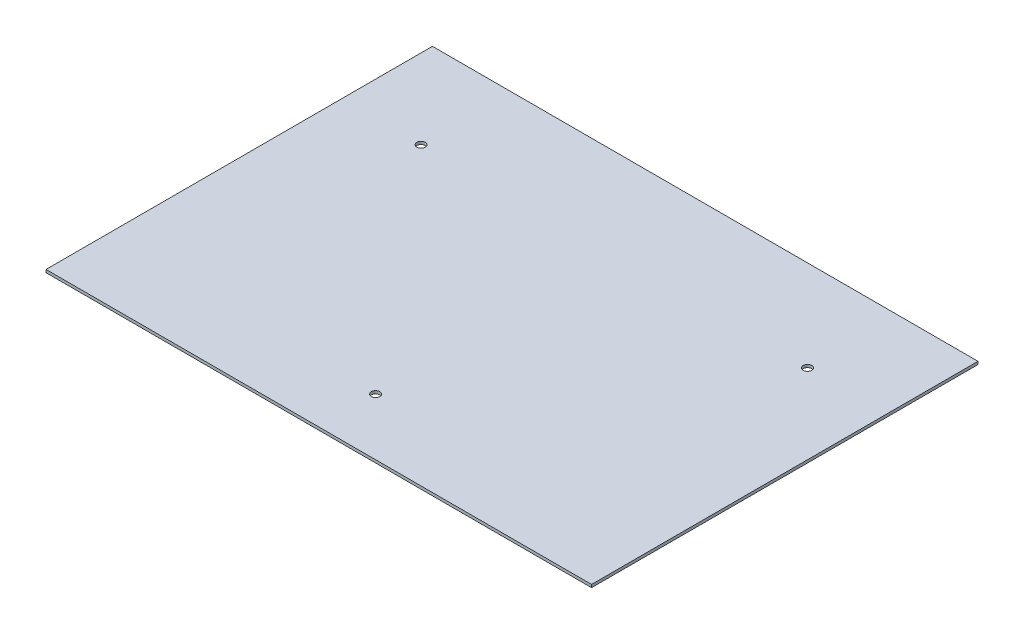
ISO-10303-21;
HEADER;
FILE_DESCRIPTION(('STEP AP214'),'2;1');
FILE_NAME('part.step','',(''),(''),'','','');
FILE_SCHEMA(('AUTOMOTIVE_DESIGN { 1 0 10303 214 1 1 1 1 }'));
ENDSEC;
DATA;
#1=APPLICATION_CONTEXT('core data for automotive mechanical design processes');
#2=APPLICATION_PROTOCOL_DEFINITION('international standard','automotive_design',2000,#1);
#3=PRODUCT_CONTEXT('',#1,'mechanical');
#4=PRODUCT('Part','Part','',(#3));
#5=PRODUCT_RELATED_PRODUCT_CATEGORY('part','',(#4));
#6=PRODUCT_DEFINITION_FORMATION('','',#4);
#7=PRODUCT_DEFINITION_CONTEXT('part definition',#1,'design');
#8=PRODUCT_DEFINITION('design','',#6,#7);
#9=PRODUCT_DEFINITION_SHAPE('','',#8);
#10=(LENGTH_UNIT() NAMED_UNIT(*) SI_UNIT(.MILLI.,.METRE.));
#11=(NAMED_UNIT(*) PLANE_ANGLE_UNIT() SI_UNIT($,.RADIAN.));
#12=(NAMED_UNIT(*) SI_UNIT($,.STERADIAN.) SOLID_ANGLE_UNIT());
#13=UNCERTAINTY_MEASURE_WITH_UNIT(LENGTH_MEASURE(1.E-05),#10,'distance_accuracy_value','');
#14=(GEOMETRIC_REPRESENTATION_CONTEXT(3) GLOBAL_UNCERTAINTY_ASSIGNED_CONTEXT((#13)) GLOBAL_UNIT_ASSIGNED_CONTEXT((#10,
#11,#12)) REPRESENTATION_CONTEXT('',''));
#15=CARTESIAN_POINT('',(0.,0.,0.));
#16=DIRECTION('',(0.,0.,1.));
#17=DIRECTION('',(1.,0.,0.));
#18=AXIS2_PLACEMENT_3D('',#15,#16,#17);
#19=CARTESIAN_POINT('',(304.8,3.175,215.9));
#20=DIRECTION('',(-1.,0.,0.));
#21=DIRECTION('',(0.,0.,1.));
#22=AXIS2_PLACEMENT_3D('',#19,#20,#21);
#23=PLANE('',#22);
#24=DIRECTION('',(0.,0.,-1.));
#25=VECTOR('',#24,1.);
#26=CARTESIAN_POINT('',(304.8,0.,215.9));
#27=LINE('',#26,#25);
#28=CARTESIAN_POINT('',(304.8,0.,215.9));
#29=VERTEX_POINT('',#28);
#30=CARTESIAN_POINT('',(304.8,0.,-215.9));
#31=VERTEX_POINT('',#30);
#32=EDGE_CURVE('E95',#29,#31,#27,.T.);
#33=ORIENTED_EDGE('',*,*,#32,.T.);
#34=DIRECTION('',(0.,-1.,0.));
#35=VECTOR('',#34,1.);
#36=CARTESIAN_POINT('',(304.8,3.175,-215.9));
#37=LINE('',#36,#35);
#38=CARTESIAN_POINT('',(304.8,3.175,-215.9));
#39=VERTEX_POINT('',#38);
#40=EDGE_CURVE('E11',#39,#31,#37,.T.);
#41=ORIENTED_EDGE('',*,*,#40,.F.);
#42=DIRECTION('',(0.,0.,-1.));
#43=VECTOR('',#42,1.);
#44=CARTESIAN_POINT('',(304.8,3.175,215.9));
#45=LINE('',#44,#43);
#46=CARTESIAN_POINT('',(304.8,3.175,215.9));
#47=VERTEX_POINT('',#46);
#48=EDGE_CURVE('E83',#47,#39,#45,.T.);
#49=ORIENTED_EDGE('',*,*,#48,.F.);
#50=DIRECTION('',(0.,-1.,0.));
#51=VECTOR('',#50,1.);
#52=CARTESIAN_POINT('',(304.8,3.175,215.9));
#53=LINE('',#52,#51);
#54=EDGE_CURVE('E91',#47,#29,#53,.T.);
#55=ORIENTED_EDGE('',*,*,#54,.T.);
#56=EDGE_LOOP('',(#33,#41,#49,#55));
#57=FACE_BOUND('',#56,.T.);
#58=ADVANCED_FACE('F32',(#57),#23,.F.);
#59=CARTESIAN_POINT('',(-304.8,3.175,-215.9));
#60=DIRECTION('',(0.,0.,1.));
#61=DIRECTION('',(1.,0.,0.));
#62=AXIS2_PLACEMENT_3D('',#59,#60,#61);
#63=PLANE('',#62);
#64=DIRECTION('',(-1.,0.,0.));
#65=VECTOR('',#64,1.);
#66=CARTESIAN_POINT('',(-304.8,0.,-215.9));
#67=LINE('',#66,#65);
#68=CARTESIAN_POINT('',(-304.8,0.,-215.9));
#69=VERTEX_POINT('',#68);
#70=EDGE_CURVE('E87',#31,#69,#67,.T.);
#71=ORIENTED_EDGE('',*,*,#70,.T.);
#72=DIRECTION('',(0.,-1.,0.));
#73=VECTOR('',#72,1.);
#74=CARTESIAN_POINT('',(-304.8,3.175,-215.9));
#75=LINE('',#74,#73);
#76=CARTESIAN_POINT('',(-304.8,3.175,-215.9));
#77=VERTEX_POINT('',#76);
#78=EDGE_CURVE('E40',#77,#69,#75,.T.);
#79=ORIENTED_EDGE('',*,*,#78,.F.);
#80=DIRECTION('',(-1.,0.,0.));
#81=VECTOR('',#80,1.);
#82=CARTESIAN_POINT('',(-304.8,3.175,-215.9));
#83=LINE('',#82,#81);
#84=EDGE_CURVE('E78',#39,#77,#83,.T.);
#85=ORIENTED_EDGE('',*,*,#84,.F.);
#86=ORIENTED_EDGE('',*,*,#40,.T.);
#87=EDGE_LOOP('',(#71,#79,#85,#86));
#88=FACE_BOUND('',#87,.T.);
#89=ADVANCED_FACE('F86',(#88),#63,.F.);
#90=CARTESIAN_POINT('',(-304.8,3.175,215.9));
#91=DIRECTION('',(1.,0.,0.));
#92=DIRECTION('',(0.,0.,-1.));
#93=AXIS2_PLACEMENT_3D('',#90,#91,#92);
#94=PLANE('',#93);
#95=DIRECTION('',(0.,0.,1.));
#96=VECTOR('',#95,1.);
#97=CARTESIAN_POINT('',(-304.8,0.,215.9));
#98=LINE('',#97,#96);
#99=CARTESIAN_POINT('',(-304.8,0.,215.9));
#100=VERTEX_POINT('',#99);
#101=EDGE_CURVE('E65',#69,#100,#98,.T.);
#102=ORIENTED_EDGE('',*,*,#101,.T.);
#103=DIRECTION('',(0.,-1.,0.));
#104=VECTOR('',#103,1.);
#105=CARTESIAN_POINT('',(-304.8,3.175,215.9));
#106=LINE('',#105,#104);
#107=CARTESIAN_POINT('',(-304.8,3.175,215.9));
#108=VERTEX_POINT('',#107);
#109=EDGE_CURVE('E88',#108,#100,#106,.T.);
#110=ORIENTED_EDGE('',*,*,#109,.F.);
#111=DIRECTION('',(0.,0.,1.));
#112=VECTOR('',#111,1.);
#113=CARTESIAN_POINT('',(-304.8,3.175,215.9));
#114=LINE('',#113,#112);
#115=EDGE_CURVE('E81',#77,#108,#114,.T.);
#116=ORIENTED_EDGE('',*,*,#115,.F.);
#117=ORIENTED_EDGE('',*,*,#78,.T.);
#118=EDGE_LOOP('',(#102,#110,#116,#117));
#119=FACE_BOUND('',#118,.T.);
#120=ADVANCED_FACE('F89',(#119),#94,.F.);
#121=CARTESIAN_POINT('',(-304.8,3.175,215.9));
#122=DIRECTION('',(0.,0.,-1.));
#123=DIRECTION('',(-1.,0.,0.));
#124=AXIS2_PLACEMENT_3D('',#121,#122,#123);
#125=PLANE('',#124);
#126=DIRECTION('',(1.,0.,0.));
#127=VECTOR('',#126,1.);
#128=CARTESIAN_POINT('',(-304.8,0.,215.9));
#129=LINE('',#128,#127);
#130=EDGE_CURVE('E71',#100,#29,#129,.T.);
#131=ORIENTED_EDGE('',*,*,#130,.T.);
#132=ORIENTED_EDGE('',*,*,#54,.F.);
#133=DIRECTION('',(1.,0.,0.));
#134=VECTOR('',#133,1.);
#135=CARTESIAN_POINT('',(-304.8,3.175,215.9));
#136=LINE('',#135,#134);
#137=EDGE_CURVE('E48',#108,#47,#136,.T.);
#138=ORIENTED_EDGE('',*,*,#137,.F.);
#139=ORIENTED_EDGE('',*,*,#109,.T.);
#140=EDGE_LOOP('',(#131,#132,#138,#139));
#141=FACE_BOUND('',#140,.T.);
#142=ADVANCED_FACE('F103',(#141),#125,.F.);
#143=CARTESIAN_POINT('',(0.,3.175,0.));
#144=DIRECTION('',(0.,-1.,0.));
#145=DIRECTION('',(0.,0.,-1.));
#146=AXIS2_PLACEMENT_3D('',#143,#144,#145);
#147=PLANE('',#146);
#148=CARTESIAN_POINT('',(0.,3.175,152.4));
#149=DIRECTION('',(0.,1.,0.));
#150=DIRECTION('',(0.,0.,1.));
#151=AXIS2_PLACEMENT_3D('',#148,#149,#150);
#152=CIRCLE('',#151,4.76249999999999);
#153=CARTESIAN_POINT('',(0.,3.175,157.1625));
#154=VERTEX_POINT('',#153);
#155=EDGE_CURVE('E121',#154,#154,#152,.T.);
#156=ORIENTED_EDGE('',*,*,#155,.F.);
#157=EDGE_LOOP('',(#156));
#158=FACE_BOUND('',#157,.T.);
#159=CARTESIAN_POINT('',(215.9,3.175,-114.3));
#160=DIRECTION('',(0.,1.,0.));
#161=DIRECTION('',(0.,0.,1.));
#162=AXIS2_PLACEMENT_3D('',#159,#160,#161);
#163=CIRCLE('',#162,4.76250000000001);
#164=CARTESIAN_POINT('',(215.9,3.175,-109.5375));
#165=VERTEX_POINT('',#164);
#166=EDGE_CURVE('E115',#165,#165,#163,.T.);
#167=ORIENTED_EDGE('',*,*,#166,.F.);
#168=EDGE_LOOP('',(#167));
#169=FACE_BOUND('',#168,.T.);
#170=CARTESIAN_POINT('',(-215.9,3.175,-114.3));
#171=DIRECTION('',(0.,1.,0.));
#172=DIRECTION('',(0.,0.,1.));
#173=AXIS2_PLACEMENT_3D('',#170,#171,#172);
#174=CIRCLE('',#173,4.76250000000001);
#175=CARTESIAN_POINT('',(-215.9,3.175,-109.5375));
#176=VERTEX_POINT('',#175);
#177=EDGE_CURVE('E109',#176,#176,#174,.T.);
#178=ORIENTED_EDGE('',*,*,#177,.F.);
#179=EDGE_LOOP('',(#178));
#180=FACE_BOUND('',#179,.T.);
#181=ORIENTED_EDGE('',*,*,#48,.T.);
#182=ORIENTED_EDGE('',*,*,#84,.T.);
#183=ORIENTED_EDGE('',*,*,#115,.T.);
#184=ORIENTED_EDGE('',*,*,#137,.T.);
#185=EDGE_LOOP('',(#181,#182,#183,#184));
#186=FACE_BOUND('',#185,.T.);
#187=ADVANCED_FACE('F79',(#158,#169,#180,#186),#147,.F.);
#188=CARTESIAN_POINT('',(0.,0.,0.));
#189=DIRECTION('',(0.,-1.,0.));
#190=DIRECTION('',(0.,0.,-1.));
#191=AXIS2_PLACEMENT_3D('',#188,#189,#190);
#192=PLANE('',#191);
#193=CARTESIAN_POINT('',(0.,0.,152.4));
#194=DIRECTION('',(0.,1.,0.));
#195=DIRECTION('',(0.,0.,1.));
#196=AXIS2_PLACEMENT_3D('',#193,#194,#195);
#197=CIRCLE('',#196,4.76249999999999);
#198=CARTESIAN_POINT('',(0.,0.,157.1625));
#199=VERTEX_POINT('',#198);
#200=EDGE_CURVE('E118',#199,#199,#197,.T.);
#201=ORIENTED_EDGE('',*,*,#200,.T.);
#202=EDGE_LOOP('',(#201));
#203=FACE_BOUND('',#202,.T.);
#204=CARTESIAN_POINT('',(215.9,0.,-114.3));
#205=DIRECTION('',(0.,1.,0.));
#206=DIRECTION('',(0.,0.,1.));
#207=AXIS2_PLACEMENT_3D('',#204,#205,#206);
#208=CIRCLE('',#207,4.76250000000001);
#209=CARTESIAN_POINT('',(215.9,0.,-109.5375));
#210=VERTEX_POINT('',#209);
#211=EDGE_CURVE('E112',#210,#210,#208,.T.);
#212=ORIENTED_EDGE('',*,*,#211,.T.);
#213=EDGE_LOOP('',(#212));
#214=FACE_BOUND('',#213,.T.);
#215=CARTESIAN_POINT('',(-215.9,0.,-114.3));
#216=DIRECTION('',(0.,1.,0.));
#217=DIRECTION('',(0.,0.,1.));
#218=AXIS2_PLACEMENT_3D('',#215,#216,#217);
#219=CIRCLE('',#218,4.76250000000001);
#220=CARTESIAN_POINT('',(-215.9,0.,-109.5375));
#221=VERTEX_POINT('',#220);
#222=EDGE_CURVE('E98',#221,#221,#219,.T.);
#223=ORIENTED_EDGE('',*,*,#222,.T.);
#224=EDGE_LOOP('',(#223));
#225=FACE_BOUND('',#224,.T.);
#226=ORIENTED_EDGE('',*,*,#32,.F.);
#227=ORIENTED_EDGE('',*,*,#130,.F.);
#228=ORIENTED_EDGE('',*,*,#101,.F.);
#229=ORIENTED_EDGE('',*,*,#70,.F.);
#230=EDGE_LOOP('',(#226,#227,#228,#229));
#231=FACE_BOUND('',#230,.T.);
#232=ADVANCED_FACE('F106',(#203,#214,#225,#231),#192,.T.);
#233=CARTESIAN_POINT('',(-215.9,0.,-114.3));
#234=DIRECTION('',(0.,1.,0.));
#235=DIRECTION('',(0.,0.,1.));
#236=AXIS2_PLACEMENT_3D('',#233,#234,#235);
#237=CYLINDRICAL_SURFACE('',#236,4.76250000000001);
#238=ORIENTED_EDGE('',*,*,#222,.F.);
#239=EDGE_LOOP('',(#238));
#240=FACE_BOUND('',#239,.T.);
#241=ORIENTED_EDGE('',*,*,#177,.T.);
#242=EDGE_LOOP('',(#241));
#243=FACE_BOUND('',#242,.T.);
#244=ADVANCED_FACE('F143',(#240,#243),#237,.F.);
#245=CARTESIAN_POINT('',(215.9,0.,-114.3));
#246=DIRECTION('',(0.,1.,0.));
#247=DIRECTION('',(0.,0.,1.));
#248=AXIS2_PLACEMENT_3D('',#245,#246,#247);
#249=CYLINDRICAL_SURFACE('',#248,4.76250000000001);
#250=ORIENTED_EDGE('',*,*,#211,.F.);
#251=EDGE_LOOP('',(#250));
#252=FACE_BOUND('',#251,.T.);
#253=ORIENTED_EDGE('',*,*,#166,.T.);
#254=EDGE_LOOP('',(#253));
#255=FACE_BOUND('',#254,.T.);
#256=ADVANCED_FACE('F132',(#252,#255),#249,.F.);
#257=CARTESIAN_POINT('',(0.,0.,152.4));
#258=DIRECTION('',(0.,1.,0.));
#259=DIRECTION('',(0.,0.,1.));
#260=AXIS2_PLACEMENT_3D('',#257,#258,#259);
#261=CYLINDRICAL_SURFACE('',#260,4.76249999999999);
#262=ORIENTED_EDGE('',*,*,#200,.F.);
#263=EDGE_LOOP('',(#262));
#264=FACE_BOUND('',#263,.T.);
#265=ORIENTED_EDGE('',*,*,#155,.T.);
#266=EDGE_LOOP('',(#265));
#267=FACE_BOUND('',#266,.T.);
#268=ADVANCED_FACE('F129',(#264,#267),#261,.F.);
#269=CLOSED_SHELL('',(#58,#89,#120,#142,#187,#232,#244,#256,#268));
#270=MANIFOLD_SOLID_BREP('B2',#269);
#271=ADVANCED_BREP_SHAPE_REPRESENTATION('',(#18,#270),#14);
#272=SHAPE_DEFINITION_REPRESENTATION(#9,#271);
ENDSEC;
END-ISO-10303-21;
